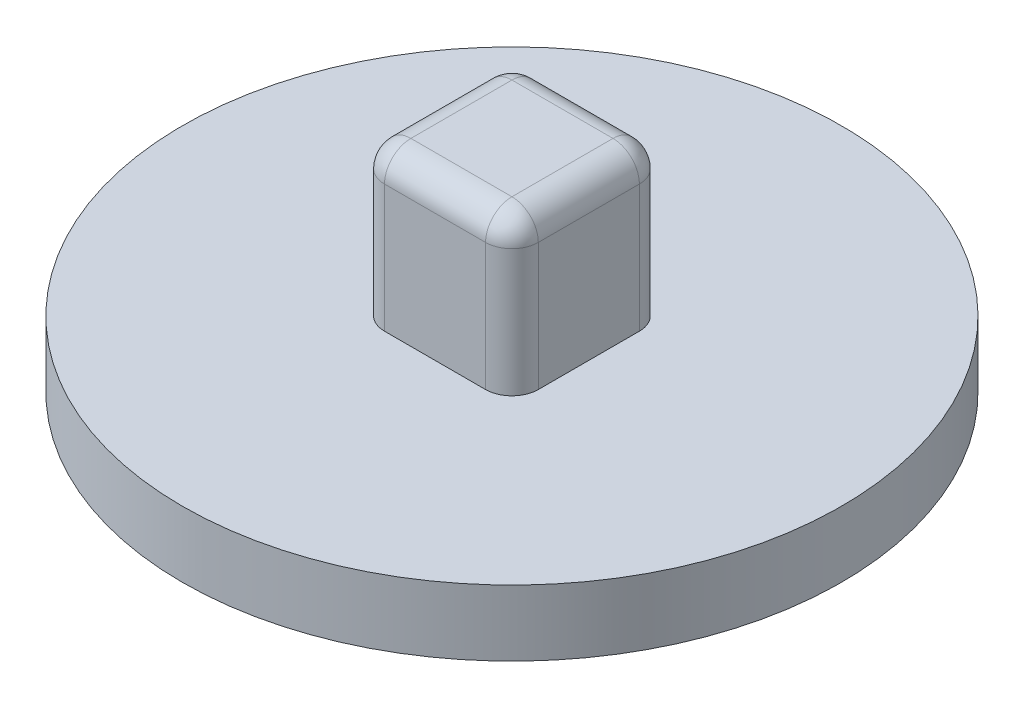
ISO-10303-21;
HEADER;
FILE_DESCRIPTION(('STEP AP214'),'2;1');
FILE_NAME('part.step','',(''),(''),'','','');
FILE_SCHEMA(('AUTOMOTIVE_DESIGN { 1 0 10303 214 1 1 1 1 }'));
ENDSEC;
DATA;
#1=APPLICATION_CONTEXT('core data for automotive mechanical design processes');
#2=APPLICATION_PROTOCOL_DEFINITION('international standard','automotive_design',2000,#1);
#3=PRODUCT_CONTEXT('',#1,'mechanical');
#4=PRODUCT('Part','Part','',(#3));
#5=PRODUCT_RELATED_PRODUCT_CATEGORY('part','',(#4));
#6=PRODUCT_DEFINITION_FORMATION('','',#4);
#7=PRODUCT_DEFINITION_CONTEXT('part definition',#1,'design');
#8=PRODUCT_DEFINITION('design','',#6,#7);
#9=PRODUCT_DEFINITION_SHAPE('','',#8);
#10=(LENGTH_UNIT() NAMED_UNIT(*) SI_UNIT(.MILLI.,.METRE.));
#11=(NAMED_UNIT(*) PLANE_ANGLE_UNIT() SI_UNIT($,.RADIAN.));
#12=(NAMED_UNIT(*) SI_UNIT($,.STERADIAN.) SOLID_ANGLE_UNIT());
#13=UNCERTAINTY_MEASURE_WITH_UNIT(LENGTH_MEASURE(1.E-05),#10,'distance_accuracy_value','');
#14=(GEOMETRIC_REPRESENTATION_CONTEXT(3) GLOBAL_UNCERTAINTY_ASSIGNED_CONTEXT((#13)) GLOBAL_UNIT_ASSIGNED_CONTEXT((#10,
#11,#12)) REPRESENTATION_CONTEXT('',''));
#15=CARTESIAN_POINT('',(0.,0.,0.));
#16=DIRECTION('',(0.,0.,1.));
#17=DIRECTION('',(1.,0.,0.));
#18=AXIS2_PLACEMENT_3D('',#15,#16,#17);
#19=CARTESIAN_POINT('',(0.,15.,0.));
#20=DIRECTION('',(0.,-1.,0.));
#21=DIRECTION('',(0.,0.,-1.));
#22=AXIS2_PLACEMENT_3D('',#19,#20,#21);
#23=CYLINDRICAL_SURFACE('',#22,75.);
#24=CARTESIAN_POINT('',(0.,15.,0.));
#25=DIRECTION('',(0.,1.,0.));
#26=DIRECTION('',(0.,0.,1.));
#27=AXIS2_PLACEMENT_3D('',#24,#25,#26);
#28=CIRCLE('',#27,75.);
#29=CARTESIAN_POINT('',(0.,15.,75.));
#30=VERTEX_POINT('',#29);
#31=EDGE_CURVE('E153',#30,#30,#28,.T.);
#32=ORIENTED_EDGE('',*,*,#31,.F.);
#33=EDGE_LOOP('',(#32));
#34=FACE_BOUND('',#33,.T.);
#35=CARTESIAN_POINT('',(0.,0.,0.));
#36=DIRECTION('',(0.,1.,0.));
#37=DIRECTION('',(0.,0.,1.));
#38=AXIS2_PLACEMENT_3D('',#35,#36,#37);
#39=CIRCLE('',#38,75.);
#40=CARTESIAN_POINT('',(0.,0.,75.));
#41=VERTEX_POINT('',#40);
#42=EDGE_CURVE('E152',#41,#41,#39,.T.);
#43=ORIENTED_EDGE('',*,*,#42,.T.);
#44=EDGE_LOOP('',(#43));
#45=FACE_BOUND('',#44,.T.);
#46=ADVANCED_FACE('F37',(#34,#45),#23,.T.);
#47=CARTESIAN_POINT('',(0.,15.,0.));
#48=DIRECTION('',(0.,1.,0.));
#49=DIRECTION('',(0.,0.,1.));
#50=AXIS2_PLACEMENT_3D('',#47,#48,#49);
#51=PLANE('',#50);
#52=DIRECTION('',(0.,0.,-1.));
#53=VECTOR('',#52,1.);
#54=CARTESIAN_POINT('',(17.5,15.,17.5));
#55=LINE('',#54,#53);
#56=CARTESIAN_POINT('',(17.5,15.,11.5));
#57=VERTEX_POINT('',#56);
#58=CARTESIAN_POINT('',(17.5,15.,-11.5));
#59=VERTEX_POINT('',#58);
#60=EDGE_CURVE('E143',#57,#59,#55,.T.);
#61=ORIENTED_EDGE('',*,*,#60,.F.);
#62=CARTESIAN_POINT('',(11.5,15.,11.5));
#63=DIRECTION('',(0.,1.,0.));
#64=DIRECTION('',(0.,0.,1.));
#65=AXIS2_PLACEMENT_3D('',#62,#63,#64);
#66=CIRCLE('',#65,6.);
#67=CARTESIAN_POINT('',(11.5,15.,17.5));
#68=VERTEX_POINT('',#67);
#69=EDGE_CURVE('E11',#57,#68,#66,.F.);
#70=ORIENTED_EDGE('',*,*,#69,.T.);
#71=DIRECTION('',(1.,0.,0.));
#72=VECTOR('',#71,1.);
#73=CARTESIAN_POINT('',(-17.5,15.,17.5));
#74=LINE('',#73,#72);
#75=CARTESIAN_POINT('',(-11.5,15.,17.5));
#76=VERTEX_POINT('',#75);
#77=EDGE_CURVE('E146',#76,#68,#74,.T.);
#78=ORIENTED_EDGE('',*,*,#77,.F.);
#79=CARTESIAN_POINT('',(-11.5,15.,11.5));
#80=DIRECTION('',(0.,1.,0.));
#81=DIRECTION('',(0.,0.,1.));
#82=AXIS2_PLACEMENT_3D('',#79,#80,#81);
#83=CIRCLE('',#82,6.);
#84=CARTESIAN_POINT('',(-17.5,15.,11.5));
#85=VERTEX_POINT('',#84);
#86=EDGE_CURVE('E46',#76,#85,#83,.F.);
#87=ORIENTED_EDGE('',*,*,#86,.T.);
#88=DIRECTION('',(0.,0.,1.));
#89=VECTOR('',#88,1.);
#90=CARTESIAN_POINT('',(-17.5,15.,17.5));
#91=LINE('',#90,#89);
#92=CARTESIAN_POINT('',(-17.5,15.,-11.5));
#93=VERTEX_POINT('',#92);
#94=EDGE_CURVE('E142',#93,#85,#91,.T.);
#95=ORIENTED_EDGE('',*,*,#94,.F.);
#96=CARTESIAN_POINT('',(-11.5,15.,-11.5));
#97=DIRECTION('',(0.,1.,0.));
#98=DIRECTION('',(0.,0.,1.));
#99=AXIS2_PLACEMENT_3D('',#96,#97,#98);
#100=CIRCLE('',#99,6.);
#101=CARTESIAN_POINT('',(-11.5,15.,-17.5));
#102=VERTEX_POINT('',#101);
#103=EDGE_CURVE('E124',#93,#102,#100,.F.);
#104=ORIENTED_EDGE('',*,*,#103,.T.);
#105=DIRECTION('',(-1.,0.,0.));
#106=VECTOR('',#105,1.);
#107=CARTESIAN_POINT('',(-17.5,15.,-17.5));
#108=LINE('',#107,#106);
#109=CARTESIAN_POINT('',(11.5,15.,-17.5));
#110=VERTEX_POINT('',#109);
#111=EDGE_CURVE('E130',#110,#102,#108,.T.);
#112=ORIENTED_EDGE('',*,*,#111,.F.);
#113=CARTESIAN_POINT('',(11.5,15.,-11.5));
#114=DIRECTION('',(0.,1.,0.));
#115=DIRECTION('',(0.,0.,1.));
#116=AXIS2_PLACEMENT_3D('',#113,#114,#115);
#117=CIRCLE('',#116,6.);
#118=EDGE_CURVE('E114',#110,#59,#117,.F.);
#119=ORIENTED_EDGE('',*,*,#118,.T.);
#120=EDGE_LOOP('',(#61,#70,#78,#87,#95,#104,#112,#119));
#121=FACE_BOUND('',#120,.T.);
#122=ORIENTED_EDGE('',*,*,#31,.T.);
#123=EDGE_LOOP('',(#122));
#124=FACE_BOUND('',#123,.T.);
#125=ADVANCED_FACE('F138',(#121,#124),#51,.T.);
#126=CARTESIAN_POINT('',(0.,0.,0.));
#127=DIRECTION('',(0.,1.,0.));
#128=DIRECTION('',(0.,0.,1.));
#129=AXIS2_PLACEMENT_3D('',#126,#127,#128);
#130=PLANE('',#129);
#131=ORIENTED_EDGE('',*,*,#42,.F.);
#132=EDGE_LOOP('',(#131));
#133=FACE_BOUND('',#132,.T.);
#134=ADVANCED_FACE('F264',(#133),#130,.F.);
#135=CARTESIAN_POINT('',(17.5,50.,17.5));
#136=DIRECTION('',(-1.,0.,0.));
#137=DIRECTION('',(0.,0.,1.));
#138=AXIS2_PLACEMENT_3D('',#135,#136,#137);
#139=PLANE('',#138);
#140=ORIENTED_EDGE('',*,*,#60,.T.);
#141=DIRECTION('',(0.,-1.,0.));
#142=VECTOR('',#141,1.);
#143=CARTESIAN_POINT('',(17.5,50.,-11.5));
#144=LINE('',#143,#142);
#145=CARTESIAN_POINT('',(17.5,44.,-11.5));
#146=VERTEX_POINT('',#145);
#147=EDGE_CURVE('E119',#59,#146,#144,.F.);
#148=ORIENTED_EDGE('',*,*,#147,.T.);
#149=DIRECTION('',(0.,0.,-1.));
#150=VECTOR('',#149,1.);
#151=CARTESIAN_POINT('',(17.5,44.,17.5));
#152=LINE('',#151,#150);
#153=CARTESIAN_POINT('',(17.5,44.,11.5));
#154=VERTEX_POINT('',#153);
#155=EDGE_CURVE('E135',#146,#154,#152,.F.);
#156=ORIENTED_EDGE('',*,*,#155,.T.);
#157=DIRECTION('',(0.,-1.,0.));
#158=VECTOR('',#157,1.);
#159=CARTESIAN_POINT('',(17.5,50.,11.5));
#160=LINE('',#159,#158);
#161=EDGE_CURVE('E161',#154,#57,#160,.T.);
#162=ORIENTED_EDGE('',*,*,#161,.T.);
#163=EDGE_LOOP('',(#140,#148,#156,#162));
#164=FACE_BOUND('',#163,.T.);
#165=ADVANCED_FACE('F270',(#164),#139,.F.);
#166=CARTESIAN_POINT('',(-17.5,50.,-17.5));
#167=DIRECTION('',(0.,0.,1.));
#168=DIRECTION('',(1.,0.,0.));
#169=AXIS2_PLACEMENT_3D('',#166,#167,#168);
#170=PLANE('',#169);
#171=DIRECTION('',(-1.,0.,0.));
#172=VECTOR('',#171,1.);
#173=CARTESIAN_POINT('',(-17.5,44.,-17.5));
#174=LINE('',#173,#172);
#175=CARTESIAN_POINT('',(-11.5,44.,-17.5));
#176=VERTEX_POINT('',#175);
#177=CARTESIAN_POINT('',(11.5,44.,-17.5));
#178=VERTEX_POINT('',#177);
#179=EDGE_CURVE('E133',#176,#178,#174,.F.);
#180=ORIENTED_EDGE('',*,*,#179,.T.);
#181=DIRECTION('',(0.,-1.,0.));
#182=VECTOR('',#181,1.);
#183=CARTESIAN_POINT('',(11.5,50.,-17.5));
#184=LINE('',#183,#182);
#185=EDGE_CURVE('E118',#178,#110,#184,.T.);
#186=ORIENTED_EDGE('',*,*,#185,.T.);
#187=ORIENTED_EDGE('',*,*,#111,.T.);
#188=DIRECTION('',(0.,-1.,0.));
#189=VECTOR('',#188,1.);
#190=CARTESIAN_POINT('',(-11.5,50.,-17.5));
#191=LINE('',#190,#189);
#192=EDGE_CURVE('E136',#102,#176,#191,.F.);
#193=ORIENTED_EDGE('',*,*,#192,.T.);
#194=EDGE_LOOP('',(#180,#186,#187,#193));
#195=FACE_BOUND('',#194,.T.);
#196=ADVANCED_FACE('F129',(#195),#170,.F.);
#197=CARTESIAN_POINT('',(-17.5,50.,17.5));
#198=DIRECTION('',(1.,0.,0.));
#199=DIRECTION('',(0.,0.,-1.));
#200=AXIS2_PLACEMENT_3D('',#197,#198,#199);
#201=PLANE('',#200);
#202=DIRECTION('',(0.,0.,1.));
#203=VECTOR('',#202,1.);
#204=CARTESIAN_POINT('',(-17.5,44.,17.5));
#205=LINE('',#204,#203);
#206=CARTESIAN_POINT('',(-17.5,44.,11.5));
#207=VERTEX_POINT('',#206);
#208=CARTESIAN_POINT('',(-17.5,44.,-11.5));
#209=VERTEX_POINT('',#208);
#210=EDGE_CURVE('E164',#207,#209,#205,.F.);
#211=ORIENTED_EDGE('',*,*,#210,.T.);
#212=DIRECTION('',(0.,-1.,0.));
#213=VECTOR('',#212,1.);
#214=CARTESIAN_POINT('',(-17.5,50.,-11.5));
#215=LINE('',#214,#213);
#216=EDGE_CURVE('E168',#209,#93,#215,.T.);
#217=ORIENTED_EDGE('',*,*,#216,.T.);
#218=ORIENTED_EDGE('',*,*,#94,.T.);
#219=DIRECTION('',(0.,-1.,0.));
#220=VECTOR('',#219,1.);
#221=CARTESIAN_POINT('',(-17.5,50.,11.5));
#222=LINE('',#221,#220);
#223=EDGE_CURVE('E166',#85,#207,#222,.F.);
#224=ORIENTED_EDGE('',*,*,#223,.T.);
#225=EDGE_LOOP('',(#211,#217,#218,#224));
#226=FACE_BOUND('',#225,.T.);
#227=ADVANCED_FACE('F278',(#226),#201,.F.);
#228=CARTESIAN_POINT('',(-17.5,50.,17.5));
#229=DIRECTION('',(0.,0.,-1.));
#230=DIRECTION('',(-1.,0.,0.));
#231=AXIS2_PLACEMENT_3D('',#228,#229,#230);
#232=PLANE('',#231);
#233=DIRECTION('',(1.,0.,0.));
#234=VECTOR('',#233,1.);
#235=CARTESIAN_POINT('',(-17.5,44.,17.5));
#236=LINE('',#235,#234);
#237=CARTESIAN_POINT('',(11.5,44.,17.5));
#238=VERTEX_POINT('',#237);
#239=CARTESIAN_POINT('',(-11.5,44.,17.5));
#240=VERTEX_POINT('',#239);
#241=EDGE_CURVE('E170',#238,#240,#236,.F.);
#242=ORIENTED_EDGE('',*,*,#241,.T.);
#243=DIRECTION('',(0.,-1.,0.));
#244=VECTOR('',#243,1.);
#245=CARTESIAN_POINT('',(-11.5,50.,17.5));
#246=LINE('',#245,#244);
#247=EDGE_CURVE('E174',#240,#76,#246,.T.);
#248=ORIENTED_EDGE('',*,*,#247,.T.);
#249=ORIENTED_EDGE('',*,*,#77,.T.);
#250=DIRECTION('',(0.,-1.,0.));
#251=VECTOR('',#250,1.);
#252=CARTESIAN_POINT('',(11.5,50.,17.5));
#253=LINE('',#252,#251);
#254=EDGE_CURVE('E172',#68,#238,#253,.F.);
#255=ORIENTED_EDGE('',*,*,#254,.T.);
#256=EDGE_LOOP('',(#242,#248,#249,#255));
#257=FACE_BOUND('',#256,.T.);
#258=ADVANCED_FACE('F228',(#257),#232,.F.);
#259=CARTESIAN_POINT('',(0.,50.,0.));
#260=DIRECTION('',(0.,-1.,0.));
#261=DIRECTION('',(0.,0.,-1.));
#262=AXIS2_PLACEMENT_3D('',#259,#260,#261);
#263=PLANE('',#262);
#264=DIRECTION('',(0.,0.,1.));
#265=VECTOR('',#264,1.);
#266=CARTESIAN_POINT('',(-11.5,50.,0.));
#267=LINE('',#266,#265);
#268=CARTESIAN_POINT('',(-11.5,50.,-11.5));
#269=VERTEX_POINT('',#268);
#270=CARTESIAN_POINT('',(-11.5,50.,11.5));
#271=VERTEX_POINT('',#270);
#272=EDGE_CURVE('E54',#269,#271,#267,.T.);
#273=ORIENTED_EDGE('',*,*,#272,.T.);
#274=DIRECTION('',(1.,0.,0.));
#275=VECTOR('',#274,1.);
#276=CARTESIAN_POINT('',(0.,50.,11.5));
#277=LINE('',#276,#275);
#278=CARTESIAN_POINT('',(11.5,50.,11.5));
#279=VERTEX_POINT('',#278);
#280=EDGE_CURVE('E125',#271,#279,#277,.T.);
#281=ORIENTED_EDGE('',*,*,#280,.T.);
#282=DIRECTION('',(0.,0.,-1.));
#283=VECTOR('',#282,1.);
#284=CARTESIAN_POINT('',(11.5,50.,0.));
#285=LINE('',#284,#283);
#286=CARTESIAN_POINT('',(11.5,50.,-11.5));
#287=VERTEX_POINT('',#286);
#288=EDGE_CURVE('E176',#279,#287,#285,.T.);
#289=ORIENTED_EDGE('',*,*,#288,.T.);
#290=DIRECTION('',(-1.,0.,0.));
#291=VECTOR('',#290,1.);
#292=CARTESIAN_POINT('',(0.,50.,-11.5));
#293=LINE('',#292,#291);
#294=EDGE_CURVE('E59',#287,#269,#293,.T.);
#295=ORIENTED_EDGE('',*,*,#294,.T.);
#296=EDGE_LOOP('',(#273,#281,#289,#295));
#297=FACE_BOUND('',#296,.T.);
#298=ADVANCED_FACE('F239',(#297),#263,.F.);
#299=CARTESIAN_POINT('',(-11.5,50.,11.5));
#300=DIRECTION('',(0.,-1.,0.));
#301=DIRECTION('',(0.,0.,-1.));
#302=AXIS2_PLACEMENT_3D('',#299,#300,#301);
#303=CYLINDRICAL_SURFACE('',#302,6.);
#304=CARTESIAN_POINT('',(-11.5,44.,11.5));
#305=DIRECTION('',(0.,1.,0.));
#306=DIRECTION('',(0.,0.,1.));
#307=AXIS2_PLACEMENT_3D('',#304,#305,#306);
#308=CIRCLE('',#307,6.);
#309=EDGE_CURVE('E41',#207,#240,#308,.T.);
#310=ORIENTED_EDGE('',*,*,#309,.F.);
#311=ORIENTED_EDGE('',*,*,#223,.F.);
#312=ORIENTED_EDGE('',*,*,#86,.F.);
#313=ORIENTED_EDGE('',*,*,#247,.F.);
#314=EDGE_LOOP('',(#310,#311,#312,#313));
#315=FACE_BOUND('',#314,.T.);
#316=ADVANCED_FACE('F39',(#315),#303,.T.);
#317=CARTESIAN_POINT('',(-11.5,44.,11.5));
#318=DIRECTION('',(0.,0.,1.));
#319=DIRECTION('',(1.,0.,0.));
#320=AXIS2_PLACEMENT_3D('',#317,#318,#319);
#321=SPHERICAL_SURFACE('',#320,6.);
#322=CARTESIAN_POINT('',(-11.5,44.,11.5));
#323=DIRECTION('',(0.,0.,1.));
#324=DIRECTION('',(1.,0.,0.));
#325=AXIS2_PLACEMENT_3D('',#322,#323,#324);
#326=CIRCLE('',#325,6.);
#327=EDGE_CURVE('E209',#207,#271,#326,.F.);
#328=ORIENTED_EDGE('',*,*,#327,.F.);
#329=ORIENTED_EDGE('',*,*,#309,.T.);
#330=CARTESIAN_POINT('',(-11.5,44.,11.5));
#331=DIRECTION('',(-1.,0.,0.));
#332=DIRECTION('',(0.,0.,1.));
#333=AXIS2_PLACEMENT_3D('',#330,#331,#332);
#334=CIRCLE('',#333,6.);
#335=EDGE_CURVE('E210',#271,#240,#334,.F.);
#336=ORIENTED_EDGE('',*,*,#335,.F.);
#337=EDGE_LOOP('',(#328,#329,#336));
#338=FACE_BOUND('',#337,.T.);
#339=ADVANCED_FACE('F220',(#338),#321,.T.);
#340=CARTESIAN_POINT('',(11.5,50.,11.5));
#341=DIRECTION('',(0.,-1.,0.));
#342=DIRECTION('',(0.,0.,-1.));
#343=AXIS2_PLACEMENT_3D('',#340,#341,#342);
#344=CYLINDRICAL_SURFACE('',#343,6.);
#345=ORIENTED_EDGE('',*,*,#69,.F.);
#346=ORIENTED_EDGE('',*,*,#161,.F.);
#347=CARTESIAN_POINT('',(11.5,44.,11.5));
#348=DIRECTION('',(0.,1.,0.));
#349=DIRECTION('',(0.,0.,1.));
#350=AXIS2_PLACEMENT_3D('',#347,#348,#349);
#351=CIRCLE('',#350,6.);
#352=EDGE_CURVE('E206',#238,#154,#351,.T.);
#353=ORIENTED_EDGE('',*,*,#352,.F.);
#354=ORIENTED_EDGE('',*,*,#254,.F.);
#355=EDGE_LOOP('',(#345,#346,#353,#354));
#356=FACE_BOUND('',#355,.T.);
#357=ADVANCED_FACE('F233',(#356),#344,.T.);
#358=CARTESIAN_POINT('',(0.,44.,11.5));
#359=DIRECTION('',(1.,0.,0.));
#360=DIRECTION('',(0.,0.,-1.));
#361=AXIS2_PLACEMENT_3D('',#358,#359,#360);
#362=CYLINDRICAL_SURFACE('',#361,6.);
#363=ORIENTED_EDGE('',*,*,#335,.T.);
#364=ORIENTED_EDGE('',*,*,#241,.F.);
#365=CARTESIAN_POINT('',(11.5,44.,11.5));
#366=DIRECTION('',(1.,0.,0.));
#367=DIRECTION('',(0.,0.,-1.));
#368=AXIS2_PLACEMENT_3D('',#365,#366,#367);
#369=CIRCLE('',#368,6.);
#370=EDGE_CURVE('E203',#279,#238,#369,.T.);
#371=ORIENTED_EDGE('',*,*,#370,.F.);
#372=ORIENTED_EDGE('',*,*,#280,.F.);
#373=EDGE_LOOP('',(#363,#364,#371,#372));
#374=FACE_BOUND('',#373,.T.);
#375=ADVANCED_FACE('F236',(#374),#362,.T.);
#376=CARTESIAN_POINT('',(-11.5,44.,0.));
#377=DIRECTION('',(0.,0.,1.));
#378=DIRECTION('',(1.,0.,0.));
#379=AXIS2_PLACEMENT_3D('',#376,#377,#378);
#380=CYLINDRICAL_SURFACE('',#379,6.);
#381=ORIENTED_EDGE('',*,*,#327,.T.);
#382=ORIENTED_EDGE('',*,*,#272,.F.);
#383=CARTESIAN_POINT('',(-11.5,44.,-11.5));
#384=DIRECTION('',(0.,0.,-1.));
#385=DIRECTION('',(0.,1.,0.));
#386=AXIS2_PLACEMENT_3D('',#383,#384,#385);
#387=CIRCLE('',#386,6.);
#388=EDGE_CURVE('E200',#209,#269,#387,.T.);
#389=ORIENTED_EDGE('',*,*,#388,.F.);
#390=ORIENTED_EDGE('',*,*,#210,.F.);
#391=EDGE_LOOP('',(#381,#382,#389,#390));
#392=FACE_BOUND('',#391,.T.);
#393=ADVANCED_FACE('F298',(#392),#380,.T.);
#394=CARTESIAN_POINT('',(-11.5,50.,-11.5));
#395=DIRECTION('',(0.,-1.,0.));
#396=DIRECTION('',(0.,0.,-1.));
#397=AXIS2_PLACEMENT_3D('',#394,#395,#396);
#398=CYLINDRICAL_SURFACE('',#397,6.);
#399=ORIENTED_EDGE('',*,*,#103,.F.);
#400=ORIENTED_EDGE('',*,*,#216,.F.);
#401=CARTESIAN_POINT('',(-11.5,44.,-11.5));
#402=DIRECTION('',(0.,1.,0.));
#403=DIRECTION('',(0.,0.,1.));
#404=AXIS2_PLACEMENT_3D('',#401,#402,#403);
#405=CIRCLE('',#404,6.);
#406=EDGE_CURVE('E197',#176,#209,#405,.T.);
#407=ORIENTED_EDGE('',*,*,#406,.F.);
#408=ORIENTED_EDGE('',*,*,#192,.F.);
#409=EDGE_LOOP('',(#399,#400,#407,#408));
#410=FACE_BOUND('',#409,.T.);
#411=ADVANCED_FACE('F301',(#410),#398,.T.);
#412=CARTESIAN_POINT('',(11.5,44.,11.5));
#413=DIRECTION('',(0.,0.,1.));
#414=DIRECTION('',(1.,0.,0.));
#415=AXIS2_PLACEMENT_3D('',#412,#413,#414);
#416=SPHERICAL_SURFACE('',#415,6.);
#417=ORIENTED_EDGE('',*,*,#370,.T.);
#418=ORIENTED_EDGE('',*,*,#352,.T.);
#419=CARTESIAN_POINT('',(11.5,44.,11.5));
#420=DIRECTION('',(0.,0.,1.));
#421=DIRECTION('',(1.,0.,0.));
#422=AXIS2_PLACEMENT_3D('',#419,#420,#421);
#423=CIRCLE('',#422,6.);
#424=EDGE_CURVE('E194',#279,#154,#423,.F.);
#425=ORIENTED_EDGE('',*,*,#424,.F.);
#426=EDGE_LOOP('',(#417,#418,#425));
#427=FACE_BOUND('',#426,.T.);
#428=ADVANCED_FACE('F305',(#427),#416,.T.);
#429=CARTESIAN_POINT('',(-11.5,44.,-11.5));
#430=DIRECTION('',(0.,0.,1.));
#431=DIRECTION('',(1.,0.,0.));
#432=AXIS2_PLACEMENT_3D('',#429,#430,#431);
#433=SPHERICAL_SURFACE('',#432,6.);
#434=ORIENTED_EDGE('',*,*,#406,.T.);
#435=ORIENTED_EDGE('',*,*,#388,.T.);
#436=CARTESIAN_POINT('',(-11.5,44.,-11.5));
#437=DIRECTION('',(-1.,0.,0.));
#438=DIRECTION('',(0.,0.,1.));
#439=AXIS2_PLACEMENT_3D('',#436,#437,#438);
#440=CIRCLE('',#439,6.);
#441=EDGE_CURVE('E191',#176,#269,#440,.F.);
#442=ORIENTED_EDGE('',*,*,#441,.F.);
#443=EDGE_LOOP('',(#434,#435,#442));
#444=FACE_BOUND('',#443,.T.);
#445=ADVANCED_FACE('F309',(#444),#433,.T.);
#446=CARTESIAN_POINT('',(11.5,44.,0.));
#447=DIRECTION('',(0.,0.,-1.));
#448=DIRECTION('',(-1.,0.,0.));
#449=AXIS2_PLACEMENT_3D('',#446,#447,#448);
#450=CYLINDRICAL_SURFACE('',#449,6.);
#451=ORIENTED_EDGE('',*,*,#424,.T.);
#452=ORIENTED_EDGE('',*,*,#155,.F.);
#453=CARTESIAN_POINT('',(11.5,44.,-11.5));
#454=DIRECTION('',(0.,0.,-1.));
#455=DIRECTION('',(-1.,0.,0.));
#456=AXIS2_PLACEMENT_3D('',#453,#454,#455);
#457=CIRCLE('',#456,6.);
#458=EDGE_CURVE('E188',#287,#146,#457,.T.);
#459=ORIENTED_EDGE('',*,*,#458,.F.);
#460=ORIENTED_EDGE('',*,*,#288,.F.);
#461=EDGE_LOOP('',(#451,#452,#459,#460));
#462=FACE_BOUND('',#461,.T.);
#463=ADVANCED_FACE('F247',(#462),#450,.T.);
#464=CARTESIAN_POINT('',(0.,44.,-11.5));
#465=DIRECTION('',(-1.,0.,0.));
#466=DIRECTION('',(0.,0.,1.));
#467=AXIS2_PLACEMENT_3D('',#464,#465,#466);
#468=CYLINDRICAL_SURFACE('',#467,6.);
#469=ORIENTED_EDGE('',*,*,#441,.T.);
#470=ORIENTED_EDGE('',*,*,#294,.F.);
#471=CARTESIAN_POINT('',(11.5,44.,-11.5));
#472=DIRECTION('',(1.,0.,0.));
#473=DIRECTION('',(0.,1.,0.));
#474=AXIS2_PLACEMENT_3D('',#471,#472,#473);
#475=CIRCLE('',#474,6.);
#476=EDGE_CURVE('E185',#178,#287,#475,.T.);
#477=ORIENTED_EDGE('',*,*,#476,.F.);
#478=ORIENTED_EDGE('',*,*,#179,.F.);
#479=EDGE_LOOP('',(#469,#470,#477,#478));
#480=FACE_BOUND('',#479,.T.);
#481=ADVANCED_FACE('F243',(#480),#468,.T.);
#482=CARTESIAN_POINT('',(11.5,44.,-11.5));
#483=DIRECTION('',(0.,0.,1.));
#484=DIRECTION('',(1.,0.,0.));
#485=AXIS2_PLACEMENT_3D('',#482,#483,#484);
#486=SPHERICAL_SURFACE('',#485,6.);
#487=ORIENTED_EDGE('',*,*,#476,.T.);
#488=ORIENTED_EDGE('',*,*,#458,.T.);
#489=CARTESIAN_POINT('',(11.5,44.,-11.5));
#490=DIRECTION('',(0.,1.,0.));
#491=DIRECTION('',(0.,0.,1.));
#492=AXIS2_PLACEMENT_3D('',#489,#490,#491);
#493=CIRCLE('',#492,6.);
#494=EDGE_CURVE('E183',#178,#146,#493,.F.);
#495=ORIENTED_EDGE('',*,*,#494,.F.);
#496=EDGE_LOOP('',(#487,#488,#495));
#497=FACE_BOUND('',#496,.T.);
#498=ADVANCED_FACE('F249',(#497),#486,.T.);
#499=CARTESIAN_POINT('',(11.5,50.,-11.5));
#500=DIRECTION('',(0.,-1.,0.));
#501=DIRECTION('',(0.,0.,-1.));
#502=AXIS2_PLACEMENT_3D('',#499,#500,#501);
#503=CYLINDRICAL_SURFACE('',#502,6.);
#504=ORIENTED_EDGE('',*,*,#494,.T.);
#505=ORIENTED_EDGE('',*,*,#147,.F.);
#506=ORIENTED_EDGE('',*,*,#118,.F.);
#507=ORIENTED_EDGE('',*,*,#185,.F.);
#508=EDGE_LOOP('',(#504,#505,#506,#507));
#509=FACE_BOUND('',#508,.T.);
#510=ADVANCED_FACE('F117',(#509),#503,.T.);
#511=CLOSED_SHELL('',(#46,#125,#134,#165,#196,#227,#258,#298,#316,#339,#357,#375,#393,#411,#428,
#445,#463,#481,#498,#510));
#512=MANIFOLD_SOLID_BREP('B2',#511);
#513=ADVANCED_BREP_SHAPE_REPRESENTATION('',(#18,#512),#14);
#514=SHAPE_DEFINITION_REPRESENTATION(#9,#513);
ENDSEC;
END-ISO-10303-21;
